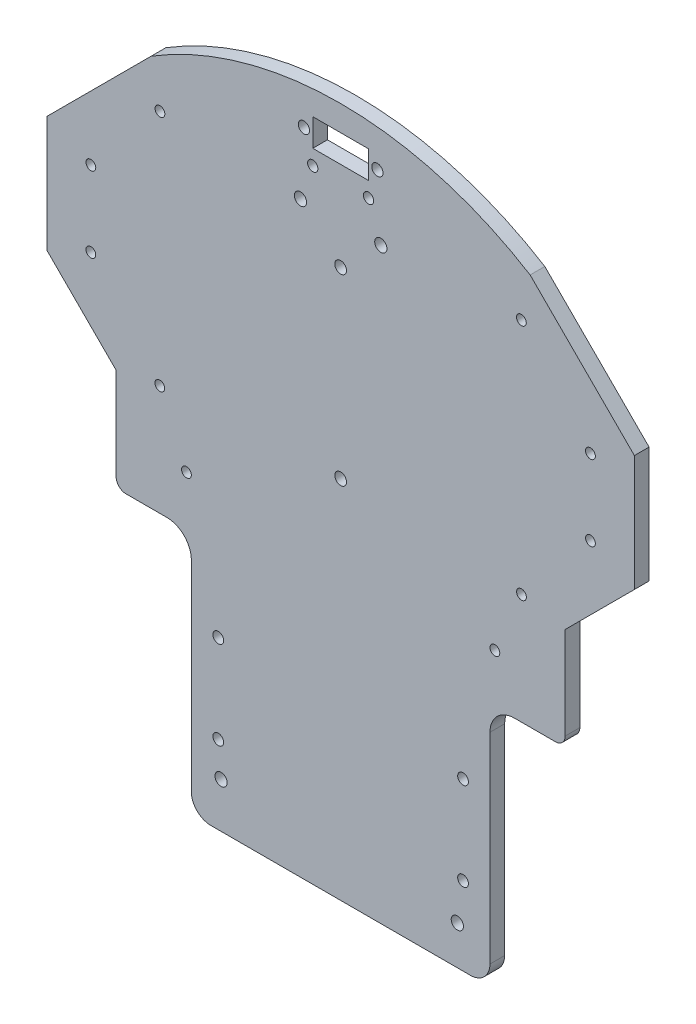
from build123d import *

# Parameters (mm, degrees)
ESQUISSE1_R             = 1.2
ESQUISSE1_R_2           = 1.25
ESQUISSE1_R_3           = 1.1
ESQUISSE1_R_4           = 1
EXTRUSION1_DEPTH        = 3
EXTRUSION2_DEPTH        = 3
ESQUISSE6_R             = 1
ESQUISSE6_R_2           = 1.15
ESQUISSE6_R_3           = 1.05
ESQUISSE6_W             = 11.4
ESQUISSE6_H             = 5.6
ENL_V_MAT_EXTRU_1_DEPTH = 135.541582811


with BuildPart() as part:
    # Esquisse1 → Extrusion1 (new body)
    with BuildSketch(Plane.XY):
        with BuildLine():
            Line((-26.5, -20.592093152), (26.5, -20.592093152))
            ThreePointArc((26.5, -20.592093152), (29.328427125, -19.420520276), (30.5, -16.592093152))
            Line((30.5, -16.592093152), (30.5, 24.407906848))
            ThreePointArc((30.5, 24.407906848), (31.964466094, 27.943440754), (35.5, 29.407906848))
            Line((35.5, 29.407906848), (43.857864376, 29.407906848))
            ThreePointArc((43.857864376, 29.407906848), (45.272077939, 29.993693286), (45.857864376, 31.407906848))
            Line((45.857864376, 31.407906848), (45.857864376, 50.265771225))
            Line((45.857864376, 50.265771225), (60, 64.407906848))
            Line((60, 64.407906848), (60, 88.107906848))
            Line((60, 88.107906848), (38.7, 109.407906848))
            Line((38.7, 109.407906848), (-38.7, 109.407906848))
            Line((-38.7, 109.407906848), (-60, 88.107906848))
            Line((-60, 88.107906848), (-60, 64.407906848))
            Line((-60, 64.407906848), (-45.857864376, 50.265771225))
            Line((-45.857864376, 50.265771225), (-45.857864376, 31.407906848))
            ThreePointArc((-45.857864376, 31.407906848), (-45.272077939, 29.993693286), (-43.857864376, 29.407906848))
            Line((-43.857864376, 29.407906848), (-35.5, 29.407906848))
            ThreePointArc((-35.5, 29.407906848), (-31.964466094, 27.943440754), (-30.5, 24.407906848))
            Line((-30.5, 24.407906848), (-30.5, -16.592093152))
            ThreePointArc((-30.5, -16.592093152), (-29.328427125, -19.420520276), (-26.5, -20.592093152))
        make_face()
        with Locations((0, 91.407906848)):
            Circle(ESQUISSE1_R, mode=Mode.SUBTRACT)
        with Locations((0, 54.007906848)):
            Circle(ESQUISSE1_R, mode=Mode.SUBTRACT)
        with Locations((8.2, 99.407906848)):
            Circle(ESQUISSE1_R_2, mode=Mode.SUBTRACT)
        with Locations(Location((-8.2, 99.407906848, 0), (0, 0, 180))):
            Circle(ESQUISSE1_R_2, mode=Mode.SUBTRACT)
        with Locations((25, -4.592093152)):
            Circle(ESQUISSE1_R_3, mode=Mode.SUBTRACT)
        with Locations(Location((25, 13.407906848, 0), (0, 0, 180))):
            Circle(ESQUISSE1_R_3, mode=Mode.SUBTRACT)
        with Locations(Location((-25, -4.592093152, 0), (0, 0, 180))):
            Circle(ESQUISSE1_R_3, mode=Mode.SUBTRACT)
        with Locations((-25, 13.407906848)):
            Circle(ESQUISSE1_R_3, mode=Mode.SUBTRACT)
        with Locations((-31.5, 39.407906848)):
            Circle(ESQUISSE1_R_4, mode=Mode.SUBTRACT)
        with Locations(Location((31.5, 39.407906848, 0), (0, 0, 180))):
            Circle(ESQUISSE1_R_4, mode=Mode.SUBTRACT)
        with Locations((-24.43, -11.392093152)):
            Circle(ESQUISSE1_R_2, mode=Mode.SUBTRACT)
        with Locations((23.83, -12.662093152)):
            Circle(ESQUISSE1_R_2, mode=Mode.SUBTRACT)
    extrude(amount=EXTRUSION1_DEPTH)

    # Esquisse5 → Extrusion2 (add)
    with BuildSketch(Plane.XY.offset(3)):
        with BuildLine():
            Line((-38.7, 109.407906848), (38.7, 109.407906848))
            ThreePointArc((38.7, 109.407906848), (0, 120.384540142), (-38.7, 109.407906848))
        make_face()
    extrude(amount=-EXTRUSION2_DEPTH)

    # Esquisse6 → Enl_v. mat.-Extru.1 (cut, through all)
    with BuildSketch(Plane.XY.offset(3)):
        with Locations((-36.913967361, 100.544435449)):
            Circle(ESQUISSE6_R)
        with Locations((-51.02271948, 83.98902733)):
            Circle(ESQUISSE6_R)
        with Locations((-51.02271948, 68.564350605)):
            Circle(ESQUISSE6_R)
        with Locations((-36.937782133, 51.995193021)):
            Circle(ESQUISSE6_R)
        with Locations(Location((36.937782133, 51.995193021, 0), (0, 0, 180))):
            Circle(ESQUISSE6_R)
        with Locations(Location((51.02271948, 68.564350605, 0), (0, 0, 180))):
            Circle(ESQUISSE6_R)
        with Locations(Location((51.02271948, 83.98902733, 0), (0, 0, 180))):
            Circle(ESQUISSE6_R)
        with Locations(Location((36.913967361, 100.544435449, 0), (0, 0, 180))):
            Circle(ESQUISSE6_R)
        with Locations((7.5, 112.407906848)):
            Circle(ESQUISSE6_R_2)
        with Locations(Location((-7.5, 112.407906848, 0), (0, 0, 180))):
            Circle(ESQUISSE6_R_2)
        with Locations((5.7, 106.507906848)):
            Circle(ESQUISSE6_R_3)
        with Locations(Location((-5.7, 106.507906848, 0), (0, 0, 180))):
            Circle(ESQUISSE6_R_3)
        with Locations((0, 112.407906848)):
            Rectangle(ESQUISSE6_W, ESQUISSE6_H)
    extrude(amount=-ENL_V_MAT_EXTRU_1_DEPTH, mode=Mode.SUBTRACT)


solid = part.part
